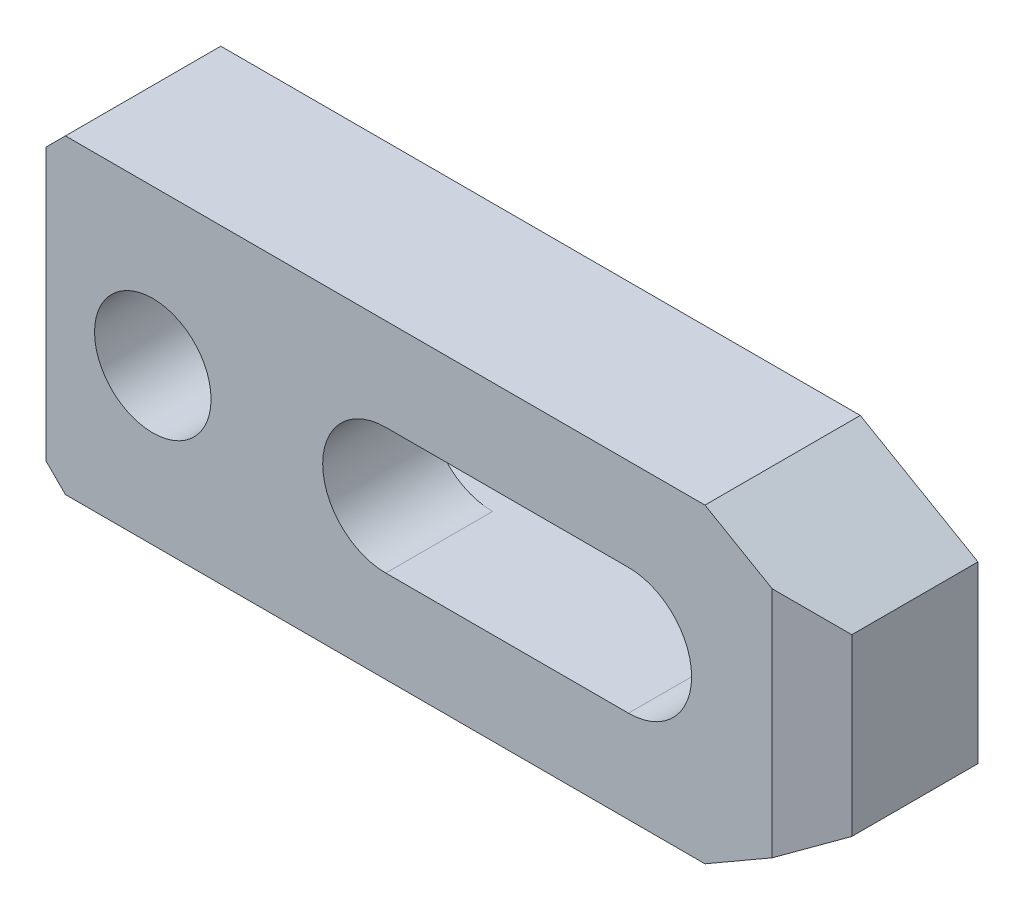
ISO-10303-21;
HEADER;
FILE_DESCRIPTION(('STEP AP214'),'2;1');
FILE_NAME('part.step','',(''),(''),'','','');
FILE_SCHEMA(('AUTOMOTIVE_DESIGN { 1 0 10303 214 1 1 1 1 }'));
ENDSEC;
DATA;
#1=APPLICATION_CONTEXT('core data for automotive mechanical design processes');
#2=APPLICATION_PROTOCOL_DEFINITION('international standard','automotive_design',2000,#1);
#3=PRODUCT_CONTEXT('',#1,'mechanical');
#4=PRODUCT('Part','Part','',(#3));
#5=PRODUCT_RELATED_PRODUCT_CATEGORY('part','',(#4));
#6=PRODUCT_DEFINITION_FORMATION('','',#4);
#7=PRODUCT_DEFINITION_CONTEXT('part definition',#1,'design');
#8=PRODUCT_DEFINITION('design','',#6,#7);
#9=PRODUCT_DEFINITION_SHAPE('','',#8);
#10=(LENGTH_UNIT() NAMED_UNIT(*) SI_UNIT(.MILLI.,.METRE.));
#11=(NAMED_UNIT(*) PLANE_ANGLE_UNIT() SI_UNIT($,.RADIAN.));
#12=(NAMED_UNIT(*) SI_UNIT($,.STERADIAN.) SOLID_ANGLE_UNIT());
#13=UNCERTAINTY_MEASURE_WITH_UNIT(LENGTH_MEASURE(1.E-05),#10,'distance_accuracy_value','');
#14=(GEOMETRIC_REPRESENTATION_CONTEXT(3) GLOBAL_UNCERTAINTY_ASSIGNED_CONTEXT((#13)) GLOBAL_UNIT_ASSIGNED_CONTEXT((#10,
#11,#12)) REPRESENTATION_CONTEXT('',''));
#15=CARTESIAN_POINT('',(0.,0.,0.));
#16=DIRECTION('',(0.,0.,1.));
#17=DIRECTION('',(1.,0.,0.));
#18=AXIS2_PLACEMENT_3D('',#15,#16,#17);
#19=CARTESIAN_POINT('',(-33.8878406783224,40.1121593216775,0.));
#20=DIRECTION('',(0.,0.,1.));
#21=DIRECTION('',(-1.,0.,0.));
#22=AXIS2_PLACEMENT_3D('',#19,#20,#21);
#23=PLANE('',#22);
#24=DIRECTION('',(0.,1.,0.));
#25=VECTOR('',#24,1.);
#26=CARTESIAN_POINT('',(-60.,-14.,0.));
#27=LINE('',#26,#25);
#28=CARTESIAN_POINT('',(-60.,-14.,0.));
#29=VERTEX_POINT('',#28);
#30=CARTESIAN_POINT('',(-60.,-6.5,0.));
#31=VERTEX_POINT('',#30);
#32=EDGE_CURVE('E147',#29,#31,#27,.T.);
#33=ORIENTED_EDGE('',*,*,#32,.T.);
#34=DIRECTION('',(-1.,0.,0.));
#35=VECTOR('',#34,1.);
#36=CARTESIAN_POINT('',(0.,-6.5,0.));
#37=LINE('',#36,#35);
#38=CARTESIAN_POINT('',(0.,-6.5,0.));
#39=VERTEX_POINT('',#38);
#40=EDGE_CURVE('E237',#39,#31,#37,.T.);
#41=ORIENTED_EDGE('',*,*,#40,.F.);
#42=CARTESIAN_POINT('',(0.,0.,0.));
#43=DIRECTION('',(0.,0.,1.));
#44=DIRECTION('',(-1.,0.,0.));
#45=AXIS2_PLACEMENT_3D('',#42,#43,#44);
#46=CIRCLE('',#45,6.5);
#47=CARTESIAN_POINT('',(0.,6.5,0.));
#48=VERTEX_POINT('',#47);
#49=EDGE_CURVE('E129',#39,#48,#46,.T.);
#50=ORIENTED_EDGE('',*,*,#49,.T.);
#51=DIRECTION('',(1.,0.,0.));
#52=VECTOR('',#51,1.);
#53=CARTESIAN_POINT('',(-25.,6.5,0.));
#54=LINE('',#53,#52);
#55=CARTESIAN_POINT('',(-60.,6.5,0.));
#56=VERTEX_POINT('',#55);
#57=EDGE_CURVE('E120',#56,#48,#54,.T.);
#58=ORIENTED_EDGE('',*,*,#57,.F.);
#59=CARTESIAN_POINT('',(-60.,14.,0.));
#60=VERTEX_POINT('',#59);
#61=EDGE_CURVE('E125',#56,#60,#27,.T.);
#62=ORIENTED_EDGE('',*,*,#61,.T.);
#63=DIRECTION('',(-0.707106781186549,-0.707106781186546,0.));
#64=VECTOR('',#63,1.);
#65=CARTESIAN_POINT('',(-58.,16.,0.));
#66=LINE('',#65,#64);
#67=CARTESIAN_POINT('',(-58.,16.,0.));
#68=VERTEX_POINT('',#67);
#69=EDGE_CURVE('E148',#68,#60,#66,.T.);
#70=ORIENTED_EDGE('',*,*,#69,.F.);
#71=DIRECTION('',(-1.,0.,0.));
#72=VECTOR('',#71,1.);
#73=CARTESIAN_POINT('',(7.87564434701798,16.,0.));
#74=LINE('',#73,#72);
#75=CARTESIAN_POINT('',(7.87564434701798,16.,0.));
#76=VERTEX_POINT('',#75);
#77=EDGE_CURVE('E151',#76,#68,#74,.T.);
#78=ORIENTED_EDGE('',*,*,#77,.F.);
#79=DIRECTION('',(-0.866025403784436,0.5,0.));
#80=VECTOR('',#79,1.);
#81=CARTESIAN_POINT('',(20.,9.,0.));
#82=LINE('',#81,#80);
#83=CARTESIAN_POINT('',(20.,9.,0.));
#84=VERTEX_POINT('',#83);
#85=EDGE_CURVE('E158',#84,#76,#82,.T.);
#86=ORIENTED_EDGE('',*,*,#85,.F.);
#87=DIRECTION('',(0.,-1.,0.));
#88=VECTOR('',#87,1.);
#89=CARTESIAN_POINT('',(20.,9.,0.));
#90=LINE('',#89,#88);
#91=CARTESIAN_POINT('',(20.,-9.,0.));
#92=VERTEX_POINT('',#91);
#93=EDGE_CURVE('E181',#84,#92,#90,.T.);
#94=ORIENTED_EDGE('',*,*,#93,.T.);
#95=DIRECTION('',(-0.86602540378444,-0.5,0.));
#96=VECTOR('',#95,1.);
#97=CARTESIAN_POINT('',(20.,-9.,0.));
#98=LINE('',#97,#96);
#99=CARTESIAN_POINT('',(7.8756443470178,-16.,0.));
#100=VERTEX_POINT('',#99);
#101=EDGE_CURVE('E208',#92,#100,#98,.T.);
#102=ORIENTED_EDGE('',*,*,#101,.T.);
#103=DIRECTION('',(-1.,0.,0.));
#104=VECTOR('',#103,1.);
#105=CARTESIAN_POINT('',(7.8756443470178,-16.,0.));
#106=LINE('',#105,#104);
#107=CARTESIAN_POINT('',(-58.,-16.,0.));
#108=VERTEX_POINT('',#107);
#109=EDGE_CURVE('E210',#100,#108,#106,.T.);
#110=ORIENTED_EDGE('',*,*,#109,.T.);
#111=DIRECTION('',(-0.707106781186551,0.707106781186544,0.));
#112=VECTOR('',#111,1.);
#113=CARTESIAN_POINT('',(-58.,-16.,0.));
#114=LINE('',#113,#112);
#115=EDGE_CURVE('E150',#108,#29,#114,.T.);
#116=ORIENTED_EDGE('',*,*,#115,.T.);
#117=EDGE_LOOP('',(#33,#41,#50,#58,#62,#70,#78,#86,#94,#102,#110,#116));
#118=FACE_BOUND('',#117,.T.);
#119=ADVANCED_FACE('F14',(#118),#23,.F.);
#120=CARTESIAN_POINT('',(-60.,-14.,16.));
#121=DIRECTION('',(-1.,0.,0.));
#122=DIRECTION('',(0.,0.,-1.));
#123=AXIS2_PLACEMENT_3D('',#120,#121,#122);
#124=PLANE('',#123);
#125=DIRECTION('',(0.,-1.,0.));
#126=VECTOR('',#125,1.);
#127=CARTESIAN_POINT('',(-60.,-14.,5.));
#128=LINE('',#127,#126);
#129=CARTESIAN_POINT('',(-60.,6.5,5.));
#130=VERTEX_POINT('',#129);
#131=CARTESIAN_POINT('',(-60.,-6.5,5.));
#132=VERTEX_POINT('',#131);
#133=EDGE_CURVE('E141',#130,#132,#128,.T.);
#134=ORIENTED_EDGE('',*,*,#133,.T.);
#135=DIRECTION('',(0.,0.,-1.));
#136=VECTOR('',#135,1.);
#137=CARTESIAN_POINT('',(-60.,-6.5,16.));
#138=LINE('',#137,#136);
#139=EDGE_CURVE('E140',#132,#31,#138,.T.);
#140=ORIENTED_EDGE('',*,*,#139,.T.);
#141=ORIENTED_EDGE('',*,*,#32,.F.);
#142=DIRECTION('',(0.,0.,-1.));
#143=VECTOR('',#142,1.);
#144=CARTESIAN_POINT('',(-60.,-14.,16.));
#145=LINE('',#144,#143);
#146=CARTESIAN_POINT('',(-60.,-14.,16.));
#147=VERTEX_POINT('',#146);
#148=EDGE_CURVE('E189',#147,#29,#145,.T.);
#149=ORIENTED_EDGE('',*,*,#148,.F.);
#150=DIRECTION('',(0.,1.,0.));
#151=VECTOR('',#150,1.);
#152=CARTESIAN_POINT('',(-60.,-14.,16.));
#153=LINE('',#152,#151);
#154=CARTESIAN_POINT('',(-60.,14.,16.));
#155=VERTEX_POINT('',#154);
#156=EDGE_CURVE('E171',#147,#155,#153,.T.);
#157=ORIENTED_EDGE('',*,*,#156,.T.);
#158=DIRECTION('',(0.,0.,-1.));
#159=VECTOR('',#158,1.);
#160=CARTESIAN_POINT('',(-60.,14.,16.));
#161=LINE('',#160,#159);
#162=EDGE_CURVE('E145',#155,#60,#161,.T.);
#163=ORIENTED_EDGE('',*,*,#162,.T.);
#164=ORIENTED_EDGE('',*,*,#61,.F.);
#165=DIRECTION('',(0.,0.,-1.));
#166=VECTOR('',#165,1.);
#167=CARTESIAN_POINT('',(-60.,6.5,16.));
#168=LINE('',#167,#166);
#169=EDGE_CURVE('E135',#130,#56,#168,.T.);
#170=ORIENTED_EDGE('',*,*,#169,.F.);
#171=EDGE_LOOP('',(#134,#140,#141,#149,#157,#163,#164,#170));
#172=FACE_BOUND('',#171,.T.);
#173=ADVANCED_FACE('F143',(#172),#124,.T.);
#174=CARTESIAN_POINT('',(-49.,0.,16.));
#175=DIRECTION('',(0.,0.,-1.));
#176=DIRECTION('',(1.,0.,0.));
#177=AXIS2_PLACEMENT_3D('',#174,#175,#176);
#178=CYLINDRICAL_SURFACE('',#177,6.);
#179=CARTESIAN_POINT('',(-49.,0.,16.));
#180=DIRECTION('',(0.,0.,1.));
#181=DIRECTION('',(-1.,0.,0.));
#182=AXIS2_PLACEMENT_3D('',#179,#180,#181);
#183=CIRCLE('',#182,6.);
#184=CARTESIAN_POINT('',(-55.,0.,16.));
#185=VERTEX_POINT('',#184);
#186=EDGE_CURVE('E161',#185,#185,#183,.T.);
#187=ORIENTED_EDGE('',*,*,#186,.T.);
#188=EDGE_LOOP('',(#187));
#189=FACE_BOUND('',#188,.T.);
#190=CARTESIAN_POINT('',(-49.,0.,5.));
#191=DIRECTION('',(0.,0.,-1.));
#192=DIRECTION('',(1.,0.,0.));
#193=AXIS2_PLACEMENT_3D('',#190,#191,#192);
#194=CIRCLE('',#193,6.);
#195=CARTESIAN_POINT('',(-43.,0.,5.));
#196=VERTEX_POINT('',#195);
#197=EDGE_CURVE('E425',#196,#196,#194,.T.);
#198=ORIENTED_EDGE('',*,*,#197,.T.);
#199=EDGE_LOOP('',(#198));
#200=FACE_BOUND('',#199,.T.);
#201=ADVANCED_FACE('F262',(#189,#200),#178,.F.);
#202=CARTESIAN_POINT('',(-25.,0.,16.));
#203=DIRECTION('',(0.,0.,-1.));
#204=DIRECTION('',(1.,0.,0.));
#205=AXIS2_PLACEMENT_3D('',#202,#203,#204);
#206=CYLINDRICAL_SURFACE('',#205,6.5);
#207=DIRECTION('',(0.,0.,-1.));
#208=VECTOR('',#207,1.);
#209=CARTESIAN_POINT('',(-25.,-6.5,16.));
#210=LINE('',#209,#208);
#211=CARTESIAN_POINT('',(-25.,-6.5,16.));
#212=VERTEX_POINT('',#211);
#213=CARTESIAN_POINT('',(-25.,-6.5,5.));
#214=VERTEX_POINT('',#213);
#215=EDGE_CURVE('E256',#212,#214,#210,.T.);
#216=ORIENTED_EDGE('',*,*,#215,.T.);
#217=CARTESIAN_POINT('',(-25.,0.,5.));
#218=DIRECTION('',(0.,0.,-1.));
#219=DIRECTION('',(1.,0.,0.));
#220=AXIS2_PLACEMENT_3D('',#217,#218,#219);
#221=CIRCLE('',#220,6.5);
#222=CARTESIAN_POINT('',(-25.,6.5,5.));
#223=VERTEX_POINT('',#222);
#224=EDGE_CURVE('E278',#214,#223,#221,.T.);
#225=ORIENTED_EDGE('',*,*,#224,.T.);
#226=DIRECTION('',(0.,0.,-1.));
#227=VECTOR('',#226,1.);
#228=CARTESIAN_POINT('',(-25.,6.5,16.));
#229=LINE('',#228,#227);
#230=CARTESIAN_POINT('',(-25.,6.5,16.));
#231=VERTEX_POINT('',#230);
#232=EDGE_CURVE('E244',#231,#223,#229,.T.);
#233=ORIENTED_EDGE('',*,*,#232,.F.);
#234=CARTESIAN_POINT('',(-25.,0.,16.));
#235=DIRECTION('',(0.,0.,1.));
#236=DIRECTION('',(-1.,0.,0.));
#237=AXIS2_PLACEMENT_3D('',#234,#235,#236);
#238=CIRCLE('',#237,6.5);
#239=EDGE_CURVE('E132',#231,#212,#238,.T.);
#240=ORIENTED_EDGE('',*,*,#239,.T.);
#241=EDGE_LOOP('',(#216,#225,#233,#240));
#242=FACE_BOUND('',#241,.T.);
#243=ADVANCED_FACE('F269',(#242),#206,.F.);
#244=CARTESIAN_POINT('',(-33.8878406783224,40.1121593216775,16.));
#245=DIRECTION('',(0.,0.,1.));
#246=DIRECTION('',(-1.,0.,0.));
#247=AXIS2_PLACEMENT_3D('',#244,#245,#246);
#248=PLANE('',#247);
#249=DIRECTION('',(0.,-1.,0.));
#250=VECTOR('',#249,1.);
#251=CARTESIAN_POINT('',(14.8038475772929,40.1121593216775,16.));
#252=LINE('',#251,#250);
#253=CARTESIAN_POINT('',(14.8038475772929,12.0000000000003,16.));
#254=VERTEX_POINT('',#253);
#255=CARTESIAN_POINT('',(14.8038475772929,-12.0000000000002,16.));
#256=VERTEX_POINT('',#255);
#257=EDGE_CURVE('E233',#254,#256,#252,.T.);
#258=ORIENTED_EDGE('',*,*,#257,.F.);
#259=DIRECTION('',(-0.866025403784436,0.5,0.));
#260=VECTOR('',#259,1.);
#261=CARTESIAN_POINT('',(20.,9.,16.));
#262=LINE('',#261,#260);
#263=CARTESIAN_POINT('',(7.87564434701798,16.,16.));
#264=VERTEX_POINT('',#263);
#265=EDGE_CURVE('E179',#254,#264,#262,.T.);
#266=ORIENTED_EDGE('',*,*,#265,.T.);
#267=DIRECTION('',(-1.,0.,0.));
#268=VECTOR('',#267,1.);
#269=CARTESIAN_POINT('',(7.87564434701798,16.,16.));
#270=LINE('',#269,#268);
#271=CARTESIAN_POINT('',(-58.,16.,16.));
#272=VERTEX_POINT('',#271);
#273=EDGE_CURVE('E176',#264,#272,#270,.T.);
#274=ORIENTED_EDGE('',*,*,#273,.T.);
#275=DIRECTION('',(-0.707106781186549,-0.707106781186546,0.));
#276=VECTOR('',#275,1.);
#277=CARTESIAN_POINT('',(-58.,16.,16.));
#278=LINE('',#277,#276);
#279=EDGE_CURVE('E173',#272,#155,#278,.T.);
#280=ORIENTED_EDGE('',*,*,#279,.T.);
#281=ORIENTED_EDGE('',*,*,#156,.F.);
#282=DIRECTION('',(-0.707106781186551,0.707106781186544,0.));
#283=VECTOR('',#282,1.);
#284=CARTESIAN_POINT('',(-58.,-16.,16.));
#285=LINE('',#284,#283);
#286=CARTESIAN_POINT('',(-58.,-16.,16.));
#287=VERTEX_POINT('',#286);
#288=EDGE_CURVE('E168',#287,#147,#285,.T.);
#289=ORIENTED_EDGE('',*,*,#288,.F.);
#290=DIRECTION('',(-1.,0.,0.));
#291=VECTOR('',#290,1.);
#292=CARTESIAN_POINT('',(7.8756443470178,-16.,16.));
#293=LINE('',#292,#291);
#294=CARTESIAN_POINT('',(7.8756443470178,-16.,16.));
#295=VERTEX_POINT('',#294);
#296=EDGE_CURVE('E165',#295,#287,#293,.T.);
#297=ORIENTED_EDGE('',*,*,#296,.F.);
#298=DIRECTION('',(-0.86602540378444,-0.5,0.));
#299=VECTOR('',#298,1.);
#300=CARTESIAN_POINT('',(20.,-9.,16.));
#301=LINE('',#300,#299);
#302=EDGE_CURVE('E162',#256,#295,#301,.T.);
#303=ORIENTED_EDGE('',*,*,#302,.F.);
#304=EDGE_LOOP('',(#258,#266,#274,#280,#281,#289,#297,#303));
#305=FACE_BOUND('',#304,.T.);
#306=ORIENTED_EDGE('',*,*,#186,.F.);
#307=EDGE_LOOP('',(#306));
#308=FACE_BOUND('',#307,.T.);
#309=DIRECTION('',(-1.,0.,0.));
#310=VECTOR('',#309,1.);
#311=CARTESIAN_POINT('',(0.,-6.5,16.));
#312=LINE('',#311,#310);
#313=CARTESIAN_POINT('',(0.,-6.5,16.));
#314=VERTEX_POINT('',#313);
#315=EDGE_CURVE('E247',#314,#212,#312,.T.);
#316=ORIENTED_EDGE('',*,*,#315,.T.);
#317=ORIENTED_EDGE('',*,*,#239,.F.);
#318=DIRECTION('',(1.,0.,0.));
#319=VECTOR('',#318,1.);
#320=CARTESIAN_POINT('',(-25.,6.5,16.));
#321=LINE('',#320,#319);
#322=CARTESIAN_POINT('',(0.,6.5,16.));
#323=VERTEX_POINT('',#322);
#324=EDGE_CURVE('E241',#231,#323,#321,.T.);
#325=ORIENTED_EDGE('',*,*,#324,.T.);
#326=CARTESIAN_POINT('',(0.,0.,16.));
#327=DIRECTION('',(0.,0.,1.));
#328=DIRECTION('',(-1.,0.,0.));
#329=AXIS2_PLACEMENT_3D('',#326,#327,#328);
#330=CIRCLE('',#329,6.5);
#331=EDGE_CURVE('E245',#314,#323,#330,.T.);
#332=ORIENTED_EDGE('',*,*,#331,.F.);
#333=EDGE_LOOP('',(#316,#317,#325,#332));
#334=FACE_BOUND('',#333,.T.);
#335=ADVANCED_FACE('F265',(#305,#308,#334),#248,.T.);
#336=CARTESIAN_POINT('',(20.,9.,16.));
#337=DIRECTION('',(-0.5,-0.866025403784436,0.));
#338=DIRECTION('',(0.866025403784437,-0.5,0.));
#339=AXIS2_PLACEMENT_3D('',#336,#337,#338);
#340=PLANE('',#339);
#341=ORIENTED_EDGE('',*,*,#265,.F.);
#342=DIRECTION('',(0.774596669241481,-0.447213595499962,-0.447213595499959));
#343=VECTOR('',#342,1.);
#344=CARTESIAN_POINT('',(18.9607695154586,9.6,13.5999999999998));
#345=LINE('',#344,#343);
#346=CARTESIAN_POINT('',(19.9999999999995,9.,13.));
#347=VERTEX_POINT('',#346);
#348=EDGE_CURVE('E235',#254,#347,#345,.T.);
#349=ORIENTED_EDGE('',*,*,#348,.T.);
#350=DIRECTION('',(0.,0.,-1.));
#351=VECTOR('',#350,1.);
#352=CARTESIAN_POINT('',(20.,9.,16.));
#353=LINE('',#352,#351);
#354=EDGE_CURVE('E164',#347,#84,#353,.T.);
#355=ORIENTED_EDGE('',*,*,#354,.T.);
#356=ORIENTED_EDGE('',*,*,#85,.T.);
#357=DIRECTION('',(0.,0.,-1.));
#358=VECTOR('',#357,1.);
#359=CARTESIAN_POINT('',(7.87564434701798,16.,16.));
#360=LINE('',#359,#358);
#361=EDGE_CURVE('E9',#264,#76,#360,.T.);
#362=ORIENTED_EDGE('',*,*,#361,.F.);
#363=EDGE_LOOP('',(#341,#349,#355,#356,#362));
#364=FACE_BOUND('',#363,.T.);
#365=ADVANCED_FACE('F268',(#364),#340,.F.);
#366=CARTESIAN_POINT('',(7.87564434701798,16.,16.));
#367=DIRECTION('',(0.,-1.,0.));
#368=DIRECTION('',(0.,0.,1.));
#369=AXIS2_PLACEMENT_3D('',#366,#367,#368);
#370=PLANE('',#369);
#371=DIRECTION('',(0.,0.,-1.));
#372=VECTOR('',#371,1.);
#373=CARTESIAN_POINT('',(-58.,16.,16.));
#374=LINE('',#373,#372);
#375=EDGE_CURVE('E22',#272,#68,#374,.T.);
#376=ORIENTED_EDGE('',*,*,#375,.F.);
#377=ORIENTED_EDGE('',*,*,#273,.F.);
#378=ORIENTED_EDGE('',*,*,#361,.T.);
#379=ORIENTED_EDGE('',*,*,#77,.T.);
#380=EDGE_LOOP('',(#376,#377,#378,#379));
#381=FACE_BOUND('',#380,.T.);
#382=ADVANCED_FACE('F16',(#381),#370,.F.);
#383=CARTESIAN_POINT('',(-58.,16.,16.));
#384=DIRECTION('',(0.707106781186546,-0.707106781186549,0.));
#385=DIRECTION('',(0.707106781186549,0.707106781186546,0.));
#386=AXIS2_PLACEMENT_3D('',#383,#384,#385);
#387=PLANE('',#386);
#388=ORIENTED_EDGE('',*,*,#162,.F.);
#389=ORIENTED_EDGE('',*,*,#279,.F.);
#390=ORIENTED_EDGE('',*,*,#375,.T.);
#391=ORIENTED_EDGE('',*,*,#69,.T.);
#392=EDGE_LOOP('',(#388,#389,#390,#391));
#393=FACE_BOUND('',#392,.T.);
#394=ADVANCED_FACE('F193',(#393),#387,.F.);
#395=CARTESIAN_POINT('',(-58.,-16.,16.));
#396=DIRECTION('',(-0.707106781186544,-0.707106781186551,0.));
#397=DIRECTION('',(0.707106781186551,-0.707106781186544,0.));
#398=AXIS2_PLACEMENT_3D('',#395,#396,#397);
#399=PLANE('',#398);
#400=DIRECTION('',(0.,0.,-1.));
#401=VECTOR('',#400,1.);
#402=CARTESIAN_POINT('',(-58.,-16.,16.));
#403=LINE('',#402,#401);
#404=EDGE_CURVE('E187',#287,#108,#403,.T.);
#405=ORIENTED_EDGE('',*,*,#404,.F.);
#406=ORIENTED_EDGE('',*,*,#288,.T.);
#407=ORIENTED_EDGE('',*,*,#148,.T.);
#408=ORIENTED_EDGE('',*,*,#115,.F.);
#409=EDGE_LOOP('',(#405,#406,#407,#408));
#410=FACE_BOUND('',#409,.T.);
#411=ADVANCED_FACE('F220',(#410),#399,.T.);
#412=CARTESIAN_POINT('',(7.8756443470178,-16.,16.));
#413=DIRECTION('',(0.,-1.,0.));
#414=DIRECTION('',(0.,0.,1.));
#415=AXIS2_PLACEMENT_3D('',#412,#413,#414);
#416=PLANE('',#415);
#417=DIRECTION('',(0.,0.,-1.));
#418=VECTOR('',#417,1.);
#419=CARTESIAN_POINT('',(7.8756443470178,-16.,16.));
#420=LINE('',#419,#418);
#421=EDGE_CURVE('E185',#295,#100,#420,.T.);
#422=ORIENTED_EDGE('',*,*,#421,.F.);
#423=ORIENTED_EDGE('',*,*,#296,.T.);
#424=ORIENTED_EDGE('',*,*,#404,.T.);
#425=ORIENTED_EDGE('',*,*,#109,.F.);
#426=EDGE_LOOP('',(#422,#423,#424,#425));
#427=FACE_BOUND('',#426,.T.);
#428=ADVANCED_FACE('F306',(#427),#416,.T.);
#429=CARTESIAN_POINT('',(20.,-9.,16.));
#430=DIRECTION('',(0.5,-0.86602540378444,0.));
#431=DIRECTION('',(0.86602540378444,0.5,0.));
#432=AXIS2_PLACEMENT_3D('',#429,#430,#431);
#433=PLANE('',#432);
#434=DIRECTION('',(0.774596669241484,0.447213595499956,-0.44721359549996));
#435=VECTOR('',#434,1.);
#436=CARTESIAN_POINT('',(18.9607695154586,-9.6,13.5999999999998));
#437=LINE('',#436,#435);
#438=CARTESIAN_POINT('',(20.,-9.,12.9999999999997));
#439=VERTEX_POINT('',#438);
#440=EDGE_CURVE('E37',#256,#439,#437,.T.);
#441=ORIENTED_EDGE('',*,*,#440,.F.);
#442=ORIENTED_EDGE('',*,*,#302,.T.);
#443=ORIENTED_EDGE('',*,*,#421,.T.);
#444=ORIENTED_EDGE('',*,*,#101,.F.);
#445=DIRECTION('',(0.,0.,-1.));
#446=VECTOR('',#445,1.);
#447=CARTESIAN_POINT('',(20.,-9.,16.));
#448=LINE('',#447,#446);
#449=EDGE_CURVE('E183',#439,#92,#448,.T.);
#450=ORIENTED_EDGE('',*,*,#449,.F.);
#451=EDGE_LOOP('',(#441,#442,#443,#444,#450));
#452=FACE_BOUND('',#451,.T.);
#453=ADVANCED_FACE('F303',(#452),#433,.T.);
#454=CARTESIAN_POINT('',(20.,9.,16.));
#455=DIRECTION('',(1.,0.,0.));
#456=DIRECTION('',(0.,0.,1.));
#457=AXIS2_PLACEMENT_3D('',#454,#455,#456);
#458=PLANE('',#457);
#459=DIRECTION('',(0.,-1.,0.));
#460=VECTOR('',#459,1.);
#461=CARTESIAN_POINT('',(19.9999999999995,20.,13.));
#462=LINE('',#461,#460);
#463=EDGE_CURVE('E227',#347,#439,#462,.T.);
#464=ORIENTED_EDGE('',*,*,#463,.T.);
#465=ORIENTED_EDGE('',*,*,#449,.T.);
#466=ORIENTED_EDGE('',*,*,#93,.F.);
#467=ORIENTED_EDGE('',*,*,#354,.F.);
#468=EDGE_LOOP('',(#464,#465,#466,#467));
#469=FACE_BOUND('',#468,.T.);
#470=ADVANCED_FACE('F205',(#469),#458,.T.);
#471=CARTESIAN_POINT('',(0.,-6.5,16.));
#472=DIRECTION('',(0.,-1.,0.));
#473=DIRECTION('',(1.,0.,0.));
#474=AXIS2_PLACEMENT_3D('',#471,#472,#473);
#475=PLANE('',#474);
#476=ORIENTED_EDGE('',*,*,#40,.T.);
#477=ORIENTED_EDGE('',*,*,#139,.F.);
#478=DIRECTION('',(1.,0.,0.));
#479=VECTOR('',#478,1.);
#480=CARTESIAN_POINT('',(-70.,-6.5,5.));
#481=LINE('',#480,#479);
#482=EDGE_CURVE('E276',#132,#214,#481,.T.);
#483=ORIENTED_EDGE('',*,*,#482,.T.);
#484=ORIENTED_EDGE('',*,*,#215,.F.);
#485=ORIENTED_EDGE('',*,*,#315,.F.);
#486=DIRECTION('',(0.,0.,-1.));
#487=VECTOR('',#486,1.);
#488=CARTESIAN_POINT('',(0.,-6.5,16.));
#489=LINE('',#488,#487);
#490=EDGE_CURVE('E255',#314,#39,#489,.T.);
#491=ORIENTED_EDGE('',*,*,#490,.T.);
#492=EDGE_LOOP('',(#476,#477,#483,#484,#485,#491));
#493=FACE_BOUND('',#492,.T.);
#494=ADVANCED_FACE('F275',(#493),#475,.F.);
#495=CARTESIAN_POINT('',(0.,0.,16.));
#496=DIRECTION('',(0.,0.,-1.));
#497=DIRECTION('',(1.,0.,0.));
#498=AXIS2_PLACEMENT_3D('',#495,#496,#497);
#499=CYLINDRICAL_SURFACE('',#498,6.5);
#500=DIRECTION('',(0.,0.,-1.));
#501=VECTOR('',#500,1.);
#502=CARTESIAN_POINT('',(0.,6.5,16.));
#503=LINE('',#502,#501);
#504=EDGE_CURVE('E253',#323,#48,#503,.T.);
#505=ORIENTED_EDGE('',*,*,#504,.T.);
#506=ORIENTED_EDGE('',*,*,#49,.F.);
#507=ORIENTED_EDGE('',*,*,#490,.F.);
#508=ORIENTED_EDGE('',*,*,#331,.T.);
#509=EDGE_LOOP('',(#505,#506,#507,#508));
#510=FACE_BOUND('',#509,.T.);
#511=ADVANCED_FACE('F280',(#510),#499,.F.);
#512=CARTESIAN_POINT('',(-25.,6.5,16.));
#513=DIRECTION('',(0.,1.,0.));
#514=DIRECTION('',(-1.,0.,0.));
#515=AXIS2_PLACEMENT_3D('',#512,#513,#514);
#516=PLANE('',#515);
#517=ORIENTED_EDGE('',*,*,#57,.T.);
#518=ORIENTED_EDGE('',*,*,#504,.F.);
#519=ORIENTED_EDGE('',*,*,#324,.F.);
#520=ORIENTED_EDGE('',*,*,#232,.T.);
#521=DIRECTION('',(1.,0.,0.));
#522=VECTOR('',#521,1.);
#523=CARTESIAN_POINT('',(-70.,6.5,5.));
#524=LINE('',#523,#522);
#525=EDGE_CURVE('E29',#130,#223,#524,.T.);
#526=ORIENTED_EDGE('',*,*,#525,.F.);
#527=ORIENTED_EDGE('',*,*,#169,.T.);
#528=EDGE_LOOP('',(#517,#518,#519,#520,#526,#527));
#529=FACE_BOUND('',#528,.T.);
#530=ADVANCED_FACE('F136',(#529),#516,.F.);
#531=CARTESIAN_POINT('',(7.87564434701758,20.,20.));
#532=DIRECTION('',(-0.5,0.,-0.866025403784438));
#533=DIRECTION('',(0.866025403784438,0.,-0.5));
#534=AXIS2_PLACEMENT_3D('',#531,#532,#533);
#535=PLANE('',#534);
#536=ORIENTED_EDGE('',*,*,#257,.T.);
#537=ORIENTED_EDGE('',*,*,#440,.T.);
#538=ORIENTED_EDGE('',*,*,#463,.F.);
#539=ORIENTED_EDGE('',*,*,#348,.F.);
#540=EDGE_LOOP('',(#536,#537,#538,#539));
#541=FACE_BOUND('',#540,.T.);
#542=ADVANCED_FACE('F288',(#541),#535,.F.);
#543=CARTESIAN_POINT('',(-70.,-6.5,5.));
#544=DIRECTION('',(0.,0.,-1.));
#545=DIRECTION('',(1.,0.,0.));
#546=AXIS2_PLACEMENT_3D('',#543,#544,#545);
#547=PLANE('',#546);
#548=ORIENTED_EDGE('',*,*,#197,.F.);
#549=EDGE_LOOP('',(#548));
#550=FACE_BOUND('',#549,.T.);
#551=ORIENTED_EDGE('',*,*,#525,.T.);
#552=ORIENTED_EDGE('',*,*,#224,.F.);
#553=ORIENTED_EDGE('',*,*,#482,.F.);
#554=ORIENTED_EDGE('',*,*,#133,.F.);
#555=EDGE_LOOP('',(#551,#552,#553,#554));
#556=FACE_BOUND('',#555,.T.);
#557=ADVANCED_FACE('F410',(#550,#556),#547,.T.);
#558=CLOSED_SHELL('',(#119,#173,#201,#243,#335,#365,#382,#394,#411,#428,#453,#470,#494,#511,
#530,#542,#557));
#559=MANIFOLD_SOLID_BREP('B1',#558);
#560=ADVANCED_BREP_SHAPE_REPRESENTATION('',(#18,#559),#14);
#561=SHAPE_DEFINITION_REPRESENTATION(#9,#560);
ENDSEC;
END-ISO-10303-21;
